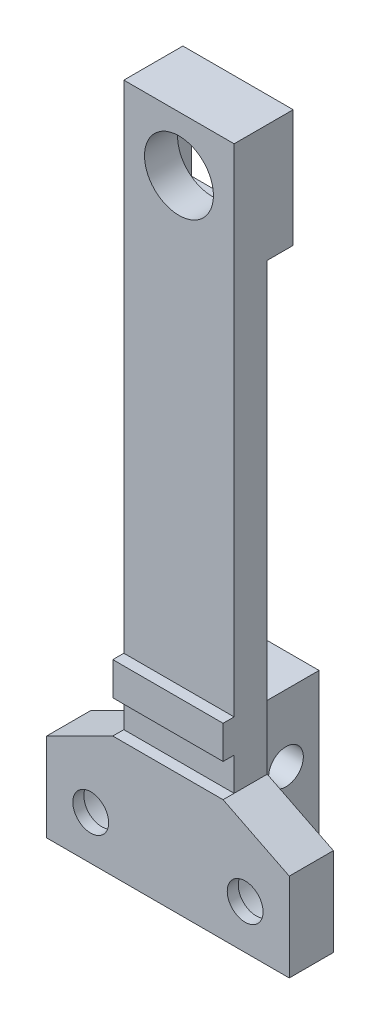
ISO-10303-21;
HEADER;
FILE_DESCRIPTION(('STEP AP214'),'2;1');
FILE_NAME('part.step','',(''),(''),'','','');
FILE_SCHEMA(('AUTOMOTIVE_DESIGN { 1 0 10303 214 1 1 1 1 }'));
ENDSEC;
DATA;
#1=APPLICATION_CONTEXT('core data for automotive mechanical design processes');
#2=APPLICATION_PROTOCOL_DEFINITION('international standard','automotive_design',2000,#1);
#3=PRODUCT_CONTEXT('',#1,'mechanical');
#4=PRODUCT('Part','Part','',(#3));
#5=PRODUCT_RELATED_PRODUCT_CATEGORY('part','',(#4));
#6=PRODUCT_DEFINITION_FORMATION('','',#4);
#7=PRODUCT_DEFINITION_CONTEXT('part definition',#1,'design');
#8=PRODUCT_DEFINITION('design','',#6,#7);
#9=PRODUCT_DEFINITION_SHAPE('','',#8);
#10=(LENGTH_UNIT() NAMED_UNIT(*) SI_UNIT(.MILLI.,.METRE.));
#11=(NAMED_UNIT(*) PLANE_ANGLE_UNIT() SI_UNIT($,.RADIAN.));
#12=(NAMED_UNIT(*) SI_UNIT($,.STERADIAN.) SOLID_ANGLE_UNIT());
#13=UNCERTAINTY_MEASURE_WITH_UNIT(LENGTH_MEASURE(1.E-05),#10,'distance_accuracy_value','');
#14=(GEOMETRIC_REPRESENTATION_CONTEXT(3) GLOBAL_UNCERTAINTY_ASSIGNED_CONTEXT((#13)) GLOBAL_UNIT_ASSIGNED_CONTEXT((#10,
#11,#12)) REPRESENTATION_CONTEXT('',''));
#15=CARTESIAN_POINT('',(0.,0.,0.));
#16=DIRECTION('',(0.,0.,1.));
#17=DIRECTION('',(1.,0.,0.));
#18=AXIS2_PLACEMENT_3D('',#15,#16,#17);
#19=CARTESIAN_POINT('',(0.,0.,0.));
#20=DIRECTION('',(0.,0.,-1.));
#21=DIRECTION('',(-1.,0.,0.));
#22=AXIS2_PLACEMENT_3D('',#19,#20,#21);
#23=PLANE('',#22);
#24=CARTESIAN_POINT('',(0.,25.,0.));
#25=DIRECTION('',(0.,0.,1.));
#26=DIRECTION('',(1.,0.,0.));
#27=AXIS2_PLACEMENT_3D('',#24,#25,#26);
#28=CIRCLE('',#27,3.125);
#29=CARTESIAN_POINT('',(3.125,25.,0.));
#30=VERTEX_POINT('',#29);
#31=EDGE_CURVE('E468',#30,#30,#28,.T.);
#32=ORIENTED_EDGE('',*,*,#31,.T.);
#33=EDGE_LOOP('',(#32));
#34=FACE_BOUND('',#33,.T.);
#35=CARTESIAN_POINT('',(-7.,-28.,0.));
#36=DIRECTION('',(0.,0.,-1.));
#37=DIRECTION('',(-1.,0.,0.));
#38=AXIS2_PLACEMENT_3D('',#35,#36,#37);
#39=CIRCLE('',#38,3.);
#40=CARTESIAN_POINT('',(-10.,-28.,0.));
#41=VERTEX_POINT('',#40);
#42=EDGE_CURVE('E423',#41,#41,#39,.T.);
#43=ORIENTED_EDGE('',*,*,#42,.F.);
#44=EDGE_LOOP('',(#43));
#45=FACE_BOUND('',#44,.T.);
#46=CARTESIAN_POINT('',(7.,-28.,0.));
#47=DIRECTION('',(0.,0.,-1.));
#48=DIRECTION('',(-1.,0.,0.));
#49=AXIS2_PLACEMENT_3D('',#46,#47,#48);
#50=CIRCLE('',#49,3.);
#51=CARTESIAN_POINT('',(4.,-28.,0.));
#52=VERTEX_POINT('',#51);
#53=EDGE_CURVE('E420',#52,#52,#50,.T.);
#54=ORIENTED_EDGE('',*,*,#53,.F.);
#55=EDGE_LOOP('',(#54));
#56=FACE_BOUND('',#55,.T.);
#57=DIRECTION('',(-1.,0.,0.));
#58=VECTOR('',#57,1.);
#59=CARTESIAN_POINT('',(-4.24632371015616,19.3710969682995,0.));
#60=LINE('',#59,#58);
#61=CARTESIAN_POINT('',(-1.,19.3710969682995,0.));
#62=VERTEX_POINT('',#61);
#63=CARTESIAN_POINT('',(-5.,19.3710969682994,0.));
#64=VERTEX_POINT('',#63);
#65=EDGE_CURVE('E389',#62,#64,#60,.T.);
#66=ORIENTED_EDGE('',*,*,#65,.F.);
#67=DIRECTION('',(0.,-1.,0.));
#68=VECTOR('',#67,1.);
#69=CARTESIAN_POINT('',(-1.,19.3710969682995,0.));
#70=LINE('',#69,#68);
#71=CARTESIAN_POINT('',(-1.,20.1710969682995,0.));
#72=VERTEX_POINT('',#71);
#73=EDGE_CURVE('E386',#72,#62,#70,.T.);
#74=ORIENTED_EDGE('',*,*,#73,.F.);
#75=DIRECTION('',(1.,0.,0.));
#76=VECTOR('',#75,1.);
#77=CARTESIAN_POINT('',(-1.,20.1710969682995,0.));
#78=LINE('',#77,#76);
#79=CARTESIAN_POINT('',(-4.2,20.1710969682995,0.));
#80=VERTEX_POINT('',#79);
#81=EDGE_CURVE('E383',#80,#72,#78,.T.);
#82=ORIENTED_EDGE('',*,*,#81,.F.);
#83=DIRECTION('',(0.,-1.,0.));
#84=VECTOR('',#83,1.);
#85=CARTESIAN_POINT('',(-4.2,29.2,0.));
#86=LINE('',#85,#84);
#87=CARTESIAN_POINT('',(-4.2,29.2,0.));
#88=VERTEX_POINT('',#87);
#89=EDGE_CURVE('E380',#88,#80,#86,.T.);
#90=ORIENTED_EDGE('',*,*,#89,.F.);
#91=DIRECTION('',(-1.,0.,0.));
#92=VECTOR('',#91,1.);
#93=CARTESIAN_POINT('',(4.2,29.2,0.));
#94=LINE('',#93,#92);
#95=CARTESIAN_POINT('',(4.2,29.2,0.));
#96=VERTEX_POINT('',#95);
#97=EDGE_CURVE('E377',#96,#88,#94,.T.);
#98=ORIENTED_EDGE('',*,*,#97,.F.);
#99=DIRECTION('',(0.,1.,0.));
#100=VECTOR('',#99,1.);
#101=CARTESIAN_POINT('',(4.2,20.143029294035,0.));
#102=LINE('',#101,#100);
#103=CARTESIAN_POINT('',(4.2,20.143029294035,0.));
#104=VERTEX_POINT('',#103);
#105=EDGE_CURVE('E374',#104,#96,#102,.T.);
#106=ORIENTED_EDGE('',*,*,#105,.F.);
#107=DIRECTION('',(1.,0.,0.));
#108=VECTOR('',#107,1.);
#109=CARTESIAN_POINT('',(0.999999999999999,20.143029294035,0.));
#110=LINE('',#109,#108);
#111=CARTESIAN_POINT('',(0.999999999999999,20.143029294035,0.));
#112=VERTEX_POINT('',#111);
#113=EDGE_CURVE('E371',#112,#104,#110,.T.);
#114=ORIENTED_EDGE('',*,*,#113,.F.);
#115=DIRECTION('',(0.,1.,0.));
#116=VECTOR('',#115,1.);
#117=CARTESIAN_POINT('',(0.999999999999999,19.343029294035,0.));
#118=LINE('',#117,#116);
#119=CARTESIAN_POINT('',(0.999999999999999,19.343029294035,0.));
#120=VERTEX_POINT('',#119);
#121=EDGE_CURVE('E368',#120,#112,#118,.T.);
#122=ORIENTED_EDGE('',*,*,#121,.F.);
#123=DIRECTION('',(-1.,0.,0.));
#124=VECTOR('',#123,1.);
#125=CARTESIAN_POINT('',(4.12072456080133,19.343029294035,0.));
#126=LINE('',#125,#124);
#127=CARTESIAN_POINT('',(5.,19.343029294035,0.));
#128=VERTEX_POINT('',#127);
#129=EDGE_CURVE('E356',#128,#120,#126,.T.);
#130=ORIENTED_EDGE('',*,*,#129,.F.);
#131=DIRECTION('',(0.,1.,0.));
#132=VECTOR('',#131,1.);
#133=CARTESIAN_POINT('',(5.,-30.,0.));
#134=LINE('',#133,#132);
#135=CARTESIAN_POINT('',(5.,-21.,0.));
#136=VERTEX_POINT('',#135);
#137=EDGE_CURVE('E511',#136,#128,#134,.T.);
#138=ORIENTED_EDGE('',*,*,#137,.F.);
#139=DIRECTION('',(0.894427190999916,-0.447213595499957,0.));
#140=VECTOR('',#139,1.);
#141=CARTESIAN_POINT('',(11.,-24.,0.));
#142=LINE('',#141,#140);
#143=CARTESIAN_POINT('',(11.,-24.,0.));
#144=VERTEX_POINT('',#143);
#145=EDGE_CURVE('E451',#136,#144,#142,.T.);
#146=ORIENTED_EDGE('',*,*,#145,.T.);
#147=DIRECTION('',(0.,-1.,0.));
#148=VECTOR('',#147,1.);
#149=CARTESIAN_POINT('',(11.,-30.,0.));
#150=LINE('',#149,#148);
#151=CARTESIAN_POINT('',(11.,-32.,0.));
#152=VERTEX_POINT('',#151);
#153=EDGE_CURVE('E460',#144,#152,#150,.T.);
#154=ORIENTED_EDGE('',*,*,#153,.T.);
#155=DIRECTION('',(-1.,0.,0.));
#156=VECTOR('',#155,1.);
#157=CARTESIAN_POINT('',(11.,-32.,0.));
#158=LINE('',#157,#156);
#159=CARTESIAN_POINT('',(-11.,-32.,0.));
#160=VERTEX_POINT('',#159);
#161=EDGE_CURVE('E419',#152,#160,#158,.T.);
#162=ORIENTED_EDGE('',*,*,#161,.T.);
#163=DIRECTION('',(0.,1.,0.));
#164=VECTOR('',#163,1.);
#165=CARTESIAN_POINT('',(-11.,-30.,0.));
#166=LINE('',#165,#164);
#167=CARTESIAN_POINT('',(-11.,-24.,0.));
#168=VERTEX_POINT('',#167);
#169=EDGE_CURVE('E444',#160,#168,#166,.T.);
#170=ORIENTED_EDGE('',*,*,#169,.T.);
#171=DIRECTION('',(0.894427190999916,0.447213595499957,0.));
#172=VECTOR('',#171,1.);
#173=CARTESIAN_POINT('',(-11.,-24.,0.));
#174=LINE('',#173,#172);
#175=CARTESIAN_POINT('',(-5.,-21.,0.));
#176=VERTEX_POINT('',#175);
#177=EDGE_CURVE('E447',#168,#176,#174,.T.);
#178=ORIENTED_EDGE('',*,*,#177,.T.);
#179=DIRECTION('',(0.,-1.,0.));
#180=VECTOR('',#179,1.);
#181=CARTESIAN_POINT('',(-5.,-30.,0.));
#182=LINE('',#181,#180);
#183=EDGE_CURVE('E518',#64,#176,#182,.T.);
#184=ORIENTED_EDGE('',*,*,#183,.F.);
#185=EDGE_LOOP('',(#66,#74,#82,#90,#98,#106,#114,#122,#130,#138,#146,#154,#162,#170,#178,#184));
#186=FACE_BOUND('',#185,.T.);
#187=DIRECTION('',(0.,1.,0.));
#188=VECTOR('',#187,1.);
#189=CARTESIAN_POINT('',(-3.7008776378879,0.,0.));
#190=LINE('',#189,#188);
#191=CARTESIAN_POINT('',(-3.7008776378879,-30.4999999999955,0.));
#192=VERTEX_POINT('',#191);
#193=CARTESIAN_POINT('',(-3.7008776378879,-16.4999999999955,0.));
#194=VERTEX_POINT('',#193);
#195=EDGE_CURVE('E65',#192,#194,#190,.T.);
#196=ORIENTED_EDGE('',*,*,#195,.F.);
#197=DIRECTION('',(-1.,0.,0.));
#198=VECTOR('',#197,1.);
#199=CARTESIAN_POINT('',(0.,-30.4999999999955,0.));
#200=LINE('',#199,#198);
#201=CARTESIAN_POINT('',(3.70087763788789,-30.4999999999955,0.));
#202=VERTEX_POINT('',#201);
#203=EDGE_CURVE('E302',#202,#192,#200,.T.);
#204=ORIENTED_EDGE('',*,*,#203,.F.);
#205=DIRECTION('',(0.,1.,0.));
#206=VECTOR('',#205,1.);
#207=CARTESIAN_POINT('',(3.70087763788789,0.,0.));
#208=LINE('',#207,#206);
#209=CARTESIAN_POINT('',(3.70087763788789,-16.4999999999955,0.));
#210=VERTEX_POINT('',#209);
#211=EDGE_CURVE('E332',#202,#210,#208,.T.);
#212=ORIENTED_EDGE('',*,*,#211,.T.);
#213=DIRECTION('',(-1.,0.,0.));
#214=VECTOR('',#213,1.);
#215=CARTESIAN_POINT('',(0.,-16.4999999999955,0.));
#216=LINE('',#215,#214);
#217=EDGE_CURVE('E330',#210,#194,#216,.T.);
#218=ORIENTED_EDGE('',*,*,#217,.T.);
#219=EDGE_LOOP('',(#196,#204,#212,#218));
#220=FACE_BOUND('',#219,.T.);
#221=ADVANCED_FACE('F43',(#34,#45,#56,#186,#220),#23,.T.);
#222=CARTESIAN_POINT('',(-5.,-30.,3.));
#223=DIRECTION('',(1.,0.,0.));
#224=DIRECTION('',(0.,0.,-1.));
#225=AXIS2_PLACEMENT_3D('',#222,#223,#224);
#226=PLANE('',#225);
#227=DIRECTION('',(0.,0.,-1.));
#228=VECTOR('',#227,1.);
#229=CARTESIAN_POINT('',(-5.,30.,3.));
#230=LINE('',#229,#228);
#231=CARTESIAN_POINT('',(-5.,30.,3.));
#232=VERTEX_POINT('',#231);
#233=CARTESIAN_POINT('',(-5.,30.,-2.35471075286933));
#234=VERTEX_POINT('',#233);
#235=EDGE_CURVE('E267',#232,#234,#230,.T.);
#236=ORIENTED_EDGE('',*,*,#235,.T.);
#237=DIRECTION('',(0.,1.,0.));
#238=VECTOR('',#237,1.);
#239=CARTESIAN_POINT('',(-5.,17.1848624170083,-2.35471075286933));
#240=LINE('',#239,#238);
#241=CARTESIAN_POINT('',(-5.,19.3710969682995,-2.35471075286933));
#242=VERTEX_POINT('',#241);
#243=EDGE_CURVE('E249',#242,#234,#240,.T.);
#244=ORIENTED_EDGE('',*,*,#243,.F.);
#245=DIRECTION('',(0.,0.,1.));
#246=VECTOR('',#245,1.);
#247=CARTESIAN_POINT('',(-5.,19.3710969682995,-15.));
#248=LINE('',#247,#246);
#249=EDGE_CURVE('E392',#242,#64,#248,.T.);
#250=ORIENTED_EDGE('',*,*,#249,.T.);
#251=ORIENTED_EDGE('',*,*,#183,.T.);
#252=DIRECTION('',(0.,0.,-1.));
#253=VECTOR('',#252,1.);
#254=CARTESIAN_POINT('',(-5.,-21.,4.));
#255=LINE('',#254,#253);
#256=CARTESIAN_POINT('',(-5.,-21.,3.));
#257=VERTEX_POINT('',#256);
#258=EDGE_CURVE('E51',#257,#176,#255,.T.);
#259=ORIENTED_EDGE('',*,*,#258,.F.);
#260=DIRECTION('',(0.,-1.,0.));
#261=VECTOR('',#260,1.);
#262=CARTESIAN_POINT('',(-5.,-30.,3.));
#263=LINE('',#262,#261);
#264=CARTESIAN_POINT('',(-5.,-18.,3.));
#265=VERTEX_POINT('',#264);
#266=EDGE_CURVE('E516',#265,#257,#263,.T.);
#267=ORIENTED_EDGE('',*,*,#266,.F.);
#268=DIRECTION('',(0.,0.,-1.));
#269=VECTOR('',#268,1.);
#270=CARTESIAN_POINT('',(-5.,-18.,4.));
#271=LINE('',#270,#269);
#272=CARTESIAN_POINT('',(-5.,-18.,4.));
#273=VERTEX_POINT('',#272);
#274=EDGE_CURVE('E471',#273,#265,#271,.T.);
#275=ORIENTED_EDGE('',*,*,#274,.F.);
#276=DIRECTION('',(0.,-1.,0.));
#277=VECTOR('',#276,1.);
#278=CARTESIAN_POINT('',(-5.,-18.,4.));
#279=LINE('',#278,#277);
#280=CARTESIAN_POINT('',(-5.,-15.,4.));
#281=VERTEX_POINT('',#280);
#282=EDGE_CURVE('E490',#281,#273,#279,.T.);
#283=ORIENTED_EDGE('',*,*,#282,.F.);
#284=DIRECTION('',(0.,0.,-1.));
#285=VECTOR('',#284,1.);
#286=CARTESIAN_POINT('',(-5.,-15.,4.));
#287=LINE('',#286,#285);
#288=CARTESIAN_POINT('',(-5.,-15.,3.));
#289=VERTEX_POINT('',#288);
#290=EDGE_CURVE('E482',#281,#289,#287,.T.);
#291=ORIENTED_EDGE('',*,*,#290,.T.);
#292=EDGE_CURVE('E271',#232,#289,#263,.T.);
#293=ORIENTED_EDGE('',*,*,#292,.F.);
#294=EDGE_LOOP('',(#236,#244,#250,#251,#259,#267,#275,#283,#291,#293));
#295=FACE_BOUND('',#294,.T.);
#296=ADVANCED_FACE('F628',(#295),#226,.F.);
#297=CARTESIAN_POINT('',(0.,0.,3.));
#298=DIRECTION('',(0.,0.,-1.));
#299=DIRECTION('',(-1.,0.,0.));
#300=AXIS2_PLACEMENT_3D('',#297,#298,#299);
#301=PLANE('',#300);
#302=DIRECTION('',(1.,0.,0.));
#303=VECTOR('',#302,1.);
#304=CARTESIAN_POINT('',(-5.,-18.,3.));
#305=LINE('',#304,#303);
#306=CARTESIAN_POINT('',(5.,-18.,3.));
#307=VERTEX_POINT('',#306);
#308=EDGE_CURVE('E489',#265,#307,#305,.T.);
#309=ORIENTED_EDGE('',*,*,#308,.F.);
#310=ORIENTED_EDGE('',*,*,#266,.T.);
#311=DIRECTION('',(-1.,0.,0.));
#312=VECTOR('',#311,1.);
#313=CARTESIAN_POINT('',(5.,-21.,3.));
#314=LINE('',#313,#312);
#315=CARTESIAN_POINT('',(5.,-21.,3.));
#316=VERTEX_POINT('',#315);
#317=EDGE_CURVE('E493',#316,#257,#314,.T.);
#318=ORIENTED_EDGE('',*,*,#317,.F.);
#319=DIRECTION('',(0.,1.,0.));
#320=VECTOR('',#319,1.);
#321=CARTESIAN_POINT('',(5.,-30.,3.));
#322=LINE('',#321,#320);
#323=EDGE_CURVE('E512',#316,#307,#322,.T.);
#324=ORIENTED_EDGE('',*,*,#323,.T.);
#325=EDGE_LOOP('',(#309,#310,#318,#324));
#326=FACE_BOUND('',#325,.T.);
#327=ADVANCED_FACE('F540',(#326),#301,.F.);
#328=CARTESIAN_POINT('',(0.,25.,3.));
#329=DIRECTION('',(0.,0.,1.));
#330=DIRECTION('',(1.,0.,0.));
#331=AXIS2_PLACEMENT_3D('',#328,#329,#330);
#332=CIRCLE('',#331,3.125);
#333=CARTESIAN_POINT('',(3.125,25.,3.));
#334=VERTEX_POINT('',#333);
#335=EDGE_CURVE('E466',#334,#334,#332,.T.);
#336=ORIENTED_EDGE('',*,*,#335,.F.);
#337=EDGE_LOOP('',(#336));
#338=FACE_BOUND('',#337,.T.);
#339=DIRECTION('',(-1.,0.,0.));
#340=VECTOR('',#339,1.);
#341=CARTESIAN_POINT('',(-5.,-15.,3.));
#342=LINE('',#341,#340);
#343=CARTESIAN_POINT('',(5.,-15.,3.));
#344=VERTEX_POINT('',#343);
#345=EDGE_CURVE('E486',#344,#289,#342,.T.);
#346=ORIENTED_EDGE('',*,*,#345,.F.);
#347=CARTESIAN_POINT('',(5.,30.,3.));
#348=VERTEX_POINT('',#347);
#349=EDGE_CURVE('E514',#344,#348,#322,.T.);
#350=ORIENTED_EDGE('',*,*,#349,.T.);
#351=DIRECTION('',(-1.,0.,0.));
#352=VECTOR('',#351,1.);
#353=CARTESIAN_POINT('',(-5.,30.,3.));
#354=LINE('',#353,#352);
#355=EDGE_CURVE('E265',#348,#232,#354,.T.);
#356=ORIENTED_EDGE('',*,*,#355,.T.);
#357=ORIENTED_EDGE('',*,*,#292,.T.);
#358=EDGE_LOOP('',(#346,#350,#356,#357));
#359=FACE_BOUND('',#358,.T.);
#360=ADVANCED_FACE('F522',(#338,#359),#301,.F.);
#361=CARTESIAN_POINT('',(5.,-30.,3.));
#362=DIRECTION('',(-1.,0.,0.));
#363=DIRECTION('',(0.,0.,1.));
#364=AXIS2_PLACEMENT_3D('',#361,#362,#363);
#365=PLANE('',#364);
#366=DIRECTION('',(0.,0.,1.));
#367=VECTOR('',#366,1.);
#368=CARTESIAN_POINT('',(5.,19.343029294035,-15.));
#369=LINE('',#368,#367);
#370=CARTESIAN_POINT('',(5.,19.343029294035,-2.35471075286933));
#371=VERTEX_POINT('',#370);
#372=EDGE_CURVE('E261',#371,#128,#369,.T.);
#373=ORIENTED_EDGE('',*,*,#372,.F.);
#374=DIRECTION('',(0.,1.,0.));
#375=VECTOR('',#374,1.);
#376=CARTESIAN_POINT('',(5.,17.1848624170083,-2.35471075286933));
#377=LINE('',#376,#375);
#378=CARTESIAN_POINT('',(5.,30.,-2.35471075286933));
#379=VERTEX_POINT('',#378);
#380=EDGE_CURVE('E246',#371,#379,#377,.T.);
#381=ORIENTED_EDGE('',*,*,#380,.T.);
#382=DIRECTION('',(0.,0.,-1.));
#383=VECTOR('',#382,1.);
#384=CARTESIAN_POINT('',(5.,30.,3.));
#385=LINE('',#384,#383);
#386=EDGE_CURVE('E259',#348,#379,#385,.T.);
#387=ORIENTED_EDGE('',*,*,#386,.F.);
#388=ORIENTED_EDGE('',*,*,#349,.F.);
#389=DIRECTION('',(0.,0.,-1.));
#390=VECTOR('',#389,1.);
#391=CARTESIAN_POINT('',(5.,-15.,4.));
#392=LINE('',#391,#390);
#393=CARTESIAN_POINT('',(5.,-15.,4.));
#394=VERTEX_POINT('',#393);
#395=EDGE_CURVE('E479',#394,#344,#392,.T.);
#396=ORIENTED_EDGE('',*,*,#395,.F.);
#397=DIRECTION('',(0.,1.,0.));
#398=VECTOR('',#397,1.);
#399=CARTESIAN_POINT('',(5.,-18.,4.));
#400=LINE('',#399,#398);
#401=CARTESIAN_POINT('',(5.,-18.,4.));
#402=VERTEX_POINT('',#401);
#403=EDGE_CURVE('E495',#402,#394,#400,.T.);
#404=ORIENTED_EDGE('',*,*,#403,.F.);
#405=DIRECTION('',(0.,0.,-1.));
#406=VECTOR('',#405,1.);
#407=CARTESIAN_POINT('',(5.,-18.,4.));
#408=LINE('',#407,#406);
#409=EDGE_CURVE('E476',#402,#307,#408,.T.);
#410=ORIENTED_EDGE('',*,*,#409,.T.);
#411=ORIENTED_EDGE('',*,*,#323,.F.);
#412=DIRECTION('',(0.,0.,-1.));
#413=VECTOR('',#412,1.);
#414=CARTESIAN_POINT('',(5.,-21.,4.));
#415=LINE('',#414,#413);
#416=EDGE_CURVE('E266',#316,#136,#415,.T.);
#417=ORIENTED_EDGE('',*,*,#416,.T.);
#418=ORIENTED_EDGE('',*,*,#137,.T.);
#419=EDGE_LOOP('',(#373,#381,#387,#388,#396,#404,#410,#411,#417,#418));
#420=FACE_BOUND('',#419,.T.);
#421=ADVANCED_FACE('F45',(#420),#365,.F.);
#422=CARTESIAN_POINT('',(-5.,30.,3.));
#423=DIRECTION('',(0.,-1.,0.));
#424=DIRECTION('',(0.,0.,-1.));
#425=AXIS2_PLACEMENT_3D('',#422,#423,#424);
#426=PLANE('',#425);
#427=ORIENTED_EDGE('',*,*,#386,.T.);
#428=DIRECTION('',(-1.,0.,0.));
#429=VECTOR('',#428,1.);
#430=CARTESIAN_POINT('',(5.,30.,-2.35471075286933));
#431=LINE('',#430,#429);
#432=EDGE_CURVE('E243',#379,#234,#431,.T.);
#433=ORIENTED_EDGE('',*,*,#432,.T.);
#434=ORIENTED_EDGE('',*,*,#235,.F.);
#435=ORIENTED_EDGE('',*,*,#355,.F.);
#436=EDGE_LOOP('',(#427,#433,#434,#435));
#437=FACE_BOUND('',#436,.T.);
#438=ADVANCED_FACE('F264',(#437),#426,.F.);
#439=CARTESIAN_POINT('',(5.,-21.,4.));
#440=DIRECTION('',(0.,-1.,0.));
#441=DIRECTION('',(0.,0.,-1.));
#442=AXIS2_PLACEMENT_3D('',#439,#440,#441);
#443=PLANE('',#442);
#444=ORIENTED_EDGE('',*,*,#317,.T.);
#445=DIRECTION('',(0.,0.,-1.));
#446=VECTOR('',#445,1.);
#447=CARTESIAN_POINT('',(-5.,-21.,4.));
#448=LINE('',#447,#446);
#449=CARTESIAN_POINT('',(-5.,-21.,4.));
#450=VERTEX_POINT('',#449);
#451=EDGE_CURVE('E503',#450,#257,#448,.T.);
#452=ORIENTED_EDGE('',*,*,#451,.F.);
#453=DIRECTION('',(-1.,0.,0.));
#454=VECTOR('',#453,1.);
#455=CARTESIAN_POINT('',(5.,-21.,4.));
#456=LINE('',#455,#454);
#457=CARTESIAN_POINT('',(5.,-21.,4.));
#458=VERTEX_POINT('',#457);
#459=EDGE_CURVE('E501',#458,#450,#456,.T.);
#460=ORIENTED_EDGE('',*,*,#459,.F.);
#461=DIRECTION('',(0.,0.,-1.));
#462=VECTOR('',#461,1.);
#463=CARTESIAN_POINT('',(5.,-21.,4.));
#464=LINE('',#463,#462);
#465=EDGE_CURVE('E508',#458,#316,#464,.T.);
#466=ORIENTED_EDGE('',*,*,#465,.T.);
#467=EDGE_LOOP('',(#444,#452,#460,#466));
#468=FACE_BOUND('',#467,.T.);
#469=ADVANCED_FACE('F544',(#468),#443,.F.);
#470=CARTESIAN_POINT('',(0.,0.,4.));
#471=DIRECTION('',(0.,0.,1.));
#472=DIRECTION('',(1.,0.,0.));
#473=AXIS2_PLACEMENT_3D('',#470,#471,#472);
#474=PLANE('',#473);
#475=CARTESIAN_POINT('',(7.,-28.,4.));
#476=DIRECTION('',(0.,0.,1.));
#477=DIRECTION('',(1.,0.,0.));
#478=AXIS2_PLACEMENT_3D('',#475,#476,#477);
#479=CIRCLE('',#478,1.625);
#480=CARTESIAN_POINT('',(8.625,-28.,4.));
#481=VERTEX_POINT('',#480);
#482=EDGE_CURVE('E278',#481,#481,#479,.T.);
#483=ORIENTED_EDGE('',*,*,#482,.F.);
#484=EDGE_LOOP('',(#483));
#485=FACE_BOUND('',#484,.T.);
#486=CARTESIAN_POINT('',(-7.,-28.,4.));
#487=DIRECTION('',(0.,0.,1.));
#488=DIRECTION('',(1.,0.,0.));
#489=AXIS2_PLACEMENT_3D('',#486,#487,#488);
#490=CIRCLE('',#489,1.625);
#491=CARTESIAN_POINT('',(-5.375,-28.,4.));
#492=VERTEX_POINT('',#491);
#493=EDGE_CURVE('E275',#492,#492,#490,.T.);
#494=ORIENTED_EDGE('',*,*,#493,.F.);
#495=EDGE_LOOP('',(#494));
#496=FACE_BOUND('',#495,.T.);
#497=DIRECTION('',(0.,1.,0.));
#498=VECTOR('',#497,1.);
#499=CARTESIAN_POINT('',(-11.,-30.,4.));
#500=LINE('',#499,#498);
#501=CARTESIAN_POINT('',(-11.,-32.,4.));
#502=VERTEX_POINT('',#501);
#503=CARTESIAN_POINT('',(-11.,-24.,4.));
#504=VERTEX_POINT('',#503);
#505=EDGE_CURVE('E443',#502,#504,#500,.T.);
#506=ORIENTED_EDGE('',*,*,#505,.F.);
#507=DIRECTION('',(-1.,0.,0.));
#508=VECTOR('',#507,1.);
#509=CARTESIAN_POINT('',(11.,-32.,4.));
#510=LINE('',#509,#508);
#511=CARTESIAN_POINT('',(11.,-32.,4.));
#512=VERTEX_POINT('',#511);
#513=EDGE_CURVE('E428',#512,#502,#510,.T.);
#514=ORIENTED_EDGE('',*,*,#513,.F.);
#515=DIRECTION('',(0.,-1.,0.));
#516=VECTOR('',#515,1.);
#517=CARTESIAN_POINT('',(11.,-30.,4.));
#518=LINE('',#517,#516);
#519=CARTESIAN_POINT('',(11.,-24.,4.));
#520=VERTEX_POINT('',#519);
#521=EDGE_CURVE('E459',#520,#512,#518,.T.);
#522=ORIENTED_EDGE('',*,*,#521,.F.);
#523=DIRECTION('',(0.894427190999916,-0.447213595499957,0.));
#524=VECTOR('',#523,1.);
#525=CARTESIAN_POINT('',(11.,-24.,4.));
#526=LINE('',#525,#524);
#527=EDGE_CURVE('E456',#458,#520,#526,.T.);
#528=ORIENTED_EDGE('',*,*,#527,.F.);
#529=ORIENTED_EDGE('',*,*,#459,.T.);
#530=DIRECTION('',(0.894427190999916,0.447213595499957,0.));
#531=VECTOR('',#530,1.);
#532=CARTESIAN_POINT('',(-11.,-24.,4.));
#533=LINE('',#532,#531);
#534=EDGE_CURVE('E448',#504,#450,#533,.T.);
#535=ORIENTED_EDGE('',*,*,#534,.F.);
#536=EDGE_LOOP('',(#506,#514,#522,#528,#529,#535));
#537=FACE_BOUND('',#536,.T.);
#538=ADVANCED_FACE('F551',(#485,#496,#537),#474,.T.);
#539=CARTESIAN_POINT('',(-5.,-18.,4.));
#540=DIRECTION('',(0.,1.,0.));
#541=DIRECTION('',(0.,0.,1.));
#542=AXIS2_PLACEMENT_3D('',#539,#540,#541);
#543=PLANE('',#542);
#544=ORIENTED_EDGE('',*,*,#308,.T.);
#545=ORIENTED_EDGE('',*,*,#409,.F.);
#546=DIRECTION('',(1.,0.,0.));
#547=VECTOR('',#546,1.);
#548=CARTESIAN_POINT('',(-5.,-18.,4.));
#549=LINE('',#548,#547);
#550=EDGE_CURVE('E497',#273,#402,#549,.T.);
#551=ORIENTED_EDGE('',*,*,#550,.F.);
#552=ORIENTED_EDGE('',*,*,#274,.T.);
#553=EDGE_LOOP('',(#544,#545,#551,#552));
#554=FACE_BOUND('',#553,.T.);
#555=ADVANCED_FACE('F536',(#554),#543,.F.);
#556=CARTESIAN_POINT('',(-5.,-15.,4.));
#557=DIRECTION('',(0.,-1.,0.));
#558=DIRECTION('',(0.,0.,-1.));
#559=AXIS2_PLACEMENT_3D('',#556,#557,#558);
#560=PLANE('',#559);
#561=ORIENTED_EDGE('',*,*,#345,.T.);
#562=ORIENTED_EDGE('',*,*,#290,.F.);
#563=DIRECTION('',(-1.,0.,0.));
#564=VECTOR('',#563,1.);
#565=CARTESIAN_POINT('',(-5.,-15.,4.));
#566=LINE('',#565,#564);
#567=EDGE_CURVE('E485',#394,#281,#566,.T.);
#568=ORIENTED_EDGE('',*,*,#567,.F.);
#569=ORIENTED_EDGE('',*,*,#395,.T.);
#570=EDGE_LOOP('',(#561,#562,#568,#569));
#571=FACE_BOUND('',#570,.T.);
#572=ADVANCED_FACE('F527',(#571),#560,.F.);
#573=CARTESIAN_POINT('',(0.,0.,4.));
#574=DIRECTION('',(0.,0.,-1.));
#575=DIRECTION('',(-1.,0.,0.));
#576=AXIS2_PLACEMENT_3D('',#573,#574,#575);
#577=PLANE('',#576);
#578=ORIENTED_EDGE('',*,*,#282,.T.);
#579=ORIENTED_EDGE('',*,*,#550,.T.);
#580=ORIENTED_EDGE('',*,*,#403,.T.);
#581=ORIENTED_EDGE('',*,*,#567,.T.);
#582=EDGE_LOOP('',(#578,#579,#580,#581));
#583=FACE_BOUND('',#582,.T.);
#584=ADVANCED_FACE('F531',(#583),#577,.F.);
#585=CARTESIAN_POINT('',(0.,25.,0.));
#586=DIRECTION('',(0.,0.,1.));
#587=DIRECTION('',(1.,0.,0.));
#588=AXIS2_PLACEMENT_3D('',#585,#586,#587);
#589=CYLINDRICAL_SURFACE('',#588,3.125);
#590=ORIENTED_EDGE('',*,*,#31,.F.);
#591=EDGE_LOOP('',(#590));
#592=FACE_BOUND('',#591,.T.);
#593=ORIENTED_EDGE('',*,*,#335,.T.);
#594=EDGE_LOOP('',(#593));
#595=FACE_BOUND('',#594,.T.);
#596=ADVANCED_FACE('F964',(#592,#595),#589,.F.);
#597=CARTESIAN_POINT('',(11.,-30.,4.));
#598=DIRECTION('',(1.,0.,0.));
#599=DIRECTION('',(0.,0.,-1.));
#600=AXIS2_PLACEMENT_3D('',#597,#598,#599);
#601=PLANE('',#600);
#602=ORIENTED_EDGE('',*,*,#153,.F.);
#603=DIRECTION('',(0.,0.,-1.));
#604=VECTOR('',#603,1.);
#605=CARTESIAN_POINT('',(11.,-24.,4.));
#606=LINE('',#605,#604);
#607=EDGE_CURVE('E462',#520,#144,#606,.T.);
#608=ORIENTED_EDGE('',*,*,#607,.F.);
#609=ORIENTED_EDGE('',*,*,#521,.T.);
#610=DIRECTION('',(0.,0.,-1.));
#611=VECTOR('',#610,1.);
#612=CARTESIAN_POINT('',(11.,-32.,4.));
#613=LINE('',#612,#611);
#614=EDGE_CURVE('E431',#512,#152,#613,.T.);
#615=ORIENTED_EDGE('',*,*,#614,.T.);
#616=EDGE_LOOP('',(#602,#608,#609,#615));
#617=FACE_BOUND('',#616,.T.);
#618=ADVANCED_FACE('F955',(#617),#601,.T.);
#619=CARTESIAN_POINT('',(11.,-24.,4.));
#620=DIRECTION('',(0.447213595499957,0.894427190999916,0.));
#621=DIRECTION('',(-0.894427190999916,0.447213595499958,0.));
#622=AXIS2_PLACEMENT_3D('',#619,#620,#621);
#623=PLANE('',#622);
#624=ORIENTED_EDGE('',*,*,#145,.F.);
#625=ORIENTED_EDGE('',*,*,#416,.F.);
#626=ORIENTED_EDGE('',*,*,#465,.F.);
#627=ORIENTED_EDGE('',*,*,#527,.T.);
#628=ORIENTED_EDGE('',*,*,#607,.T.);
#629=EDGE_LOOP('',(#624,#625,#626,#627,#628));
#630=FACE_BOUND('',#629,.T.);
#631=ADVANCED_FACE('F564',(#630),#623,.T.);
#632=CARTESIAN_POINT('',(-11.,-24.,4.));
#633=DIRECTION('',(-0.447213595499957,0.894427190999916,0.));
#634=DIRECTION('',(-0.894427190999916,-0.447213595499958,0.));
#635=AXIS2_PLACEMENT_3D('',#632,#633,#634);
#636=PLANE('',#635);
#637=ORIENTED_EDGE('',*,*,#177,.F.);
#638=DIRECTION('',(0.,0.,-1.));
#639=VECTOR('',#638,1.);
#640=CARTESIAN_POINT('',(-11.,-24.,4.));
#641=LINE('',#640,#639);
#642=EDGE_CURVE('E437',#504,#168,#641,.T.);
#643=ORIENTED_EDGE('',*,*,#642,.F.);
#644=ORIENTED_EDGE('',*,*,#534,.T.);
#645=ORIENTED_EDGE('',*,*,#451,.T.);
#646=ORIENTED_EDGE('',*,*,#258,.T.);
#647=EDGE_LOOP('',(#637,#643,#644,#645,#646));
#648=FACE_BOUND('',#647,.T.);
#649=ADVANCED_FACE('F548',(#648),#636,.T.);
#650=CARTESIAN_POINT('',(-11.,-30.,4.));
#651=DIRECTION('',(-1.,0.,0.));
#652=DIRECTION('',(0.,0.,1.));
#653=AXIS2_PLACEMENT_3D('',#650,#651,#652);
#654=PLANE('',#653);
#655=ORIENTED_EDGE('',*,*,#169,.F.);
#656=DIRECTION('',(0.,0.,-1.));
#657=VECTOR('',#656,1.);
#658=CARTESIAN_POINT('',(-11.,-32.,4.));
#659=LINE('',#658,#657);
#660=EDGE_CURVE('E434',#502,#160,#659,.T.);
#661=ORIENTED_EDGE('',*,*,#660,.F.);
#662=ORIENTED_EDGE('',*,*,#505,.T.);
#663=ORIENTED_EDGE('',*,*,#642,.T.);
#664=EDGE_LOOP('',(#655,#661,#662,#663));
#665=FACE_BOUND('',#664,.T.);
#666=ADVANCED_FACE('F556',(#665),#654,.T.);
#667=CARTESIAN_POINT('',(11.,-32.,4.));
#668=DIRECTION('',(0.,-1.,0.));
#669=DIRECTION('',(0.,0.,-1.));
#670=AXIS2_PLACEMENT_3D('',#667,#668,#669);
#671=PLANE('',#670);
#672=ORIENTED_EDGE('',*,*,#161,.F.);
#673=ORIENTED_EDGE('',*,*,#614,.F.);
#674=ORIENTED_EDGE('',*,*,#513,.T.);
#675=ORIENTED_EDGE('',*,*,#660,.T.);
#676=EDGE_LOOP('',(#672,#673,#674,#675));
#677=FACE_BOUND('',#676,.T.);
#678=ADVANCED_FACE('F560',(#677),#671,.T.);
#679=CARTESIAN_POINT('',(-7.,-28.,3.));
#680=DIRECTION('',(0.,0.,-1.));
#681=DIRECTION('',(-1.,0.,0.));
#682=AXIS2_PLACEMENT_3D('',#679,#680,#681);
#683=CYLINDRICAL_SURFACE('',#682,3.);
#684=CARTESIAN_POINT('',(-7.,-28.,3.));
#685=DIRECTION('',(0.,0.,-1.));
#686=DIRECTION('',(-1.,0.,0.));
#687=AXIS2_PLACEMENT_3D('',#684,#685,#686);
#688=CIRCLE('',#687,3.);
#689=CARTESIAN_POINT('',(-10.,-28.,3.));
#690=VERTEX_POINT('',#689);
#691=EDGE_CURVE('E281',#690,#690,#688,.T.);
#692=ORIENTED_EDGE('',*,*,#691,.F.);
#693=EDGE_LOOP('',(#692));
#694=FACE_BOUND('',#693,.T.);
#695=ORIENTED_EDGE('',*,*,#42,.T.);
#696=EDGE_LOOP('',(#695));
#697=FACE_BOUND('',#696,.T.);
#698=ADVANCED_FACE('F911',(#694,#697),#683,.F.);
#699=CARTESIAN_POINT('',(-7.,-28.,3.));
#700=DIRECTION('',(0.,0.,-1.));
#701=DIRECTION('',(-1.,0.,0.));
#702=AXIS2_PLACEMENT_3D('',#699,#700,#701);
#703=PLANE('',#702);
#704=CARTESIAN_POINT('',(-7.,-28.,3.));
#705=DIRECTION('',(0.,0.,-1.));
#706=DIRECTION('',(-1.,0.,0.));
#707=AXIS2_PLACEMENT_3D('',#704,#705,#706);
#708=CIRCLE('',#707,1.625);
#709=CARTESIAN_POINT('',(-8.625,-28.,3.));
#710=VERTEX_POINT('',#709);
#711=EDGE_CURVE('E411',#710,#710,#708,.T.);
#712=ORIENTED_EDGE('',*,*,#711,.F.);
#713=EDGE_LOOP('',(#712));
#714=FACE_BOUND('',#713,.T.);
#715=ORIENTED_EDGE('',*,*,#691,.T.);
#716=EDGE_LOOP('',(#715));
#717=FACE_BOUND('',#716,.T.);
#718=ADVANCED_FACE('F901',(#714,#717),#703,.T.);
#719=CARTESIAN_POINT('',(7.,-28.,3.));
#720=DIRECTION('',(0.,0.,-1.));
#721=DIRECTION('',(-1.,0.,0.));
#722=AXIS2_PLACEMENT_3D('',#719,#720,#721);
#723=CYLINDRICAL_SURFACE('',#722,3.);
#724=CARTESIAN_POINT('',(7.,-28.,3.));
#725=DIRECTION('',(0.,0.,-1.));
#726=DIRECTION('',(-1.,0.,0.));
#727=AXIS2_PLACEMENT_3D('',#724,#725,#726);
#728=CIRCLE('',#727,3.);
#729=CARTESIAN_POINT('',(4.,-28.,3.));
#730=VERTEX_POINT('',#729);
#731=EDGE_CURVE('E416',#730,#730,#728,.T.);
#732=ORIENTED_EDGE('',*,*,#731,.F.);
#733=EDGE_LOOP('',(#732));
#734=FACE_BOUND('',#733,.T.);
#735=ORIENTED_EDGE('',*,*,#53,.T.);
#736=EDGE_LOOP('',(#735));
#737=FACE_BOUND('',#736,.T.);
#738=ADVANCED_FACE('F891',(#734,#737),#723,.F.);
#739=CARTESIAN_POINT('',(7.,-28.,3.));
#740=DIRECTION('',(0.,0.,-1.));
#741=DIRECTION('',(-1.,0.,0.));
#742=AXIS2_PLACEMENT_3D('',#739,#740,#741);
#743=PLANE('',#742);
#744=CARTESIAN_POINT('',(7.,-28.,3.));
#745=DIRECTION('',(0.,0.,-1.));
#746=DIRECTION('',(-1.,0.,0.));
#747=AXIS2_PLACEMENT_3D('',#744,#745,#746);
#748=CIRCLE('',#747,1.625);
#749=CARTESIAN_POINT('',(5.375,-28.,3.));
#750=VERTEX_POINT('',#749);
#751=EDGE_CURVE('E279',#750,#750,#748,.T.);
#752=ORIENTED_EDGE('',*,*,#751,.F.);
#753=EDGE_LOOP('',(#752));
#754=FACE_BOUND('',#753,.T.);
#755=ORIENTED_EDGE('',*,*,#731,.T.);
#756=EDGE_LOOP('',(#755));
#757=FACE_BOUND('',#756,.T.);
#758=ADVANCED_FACE('F881',(#754,#757),#743,.T.);
#759=CARTESIAN_POINT('',(-7.,-28.,7.));
#760=DIRECTION('',(0.,0.,-1.));
#761=DIRECTION('',(-1.,0.,0.));
#762=AXIS2_PLACEMENT_3D('',#759,#760,#761);
#763=CYLINDRICAL_SURFACE('',#762,1.625);
#764=ORIENTED_EDGE('',*,*,#493,.T.);
#765=EDGE_LOOP('',(#764));
#766=FACE_BOUND('',#765,.T.);
#767=ORIENTED_EDGE('',*,*,#711,.T.);
#768=EDGE_LOOP('',(#767));
#769=FACE_BOUND('',#768,.T.);
#770=ADVANCED_FACE('F871',(#766,#769),#763,.F.);
#771=CARTESIAN_POINT('',(7.,-28.,7.));
#772=DIRECTION('',(0.,0.,-1.));
#773=DIRECTION('',(-1.,0.,0.));
#774=AXIS2_PLACEMENT_3D('',#771,#772,#773);
#775=CYLINDRICAL_SURFACE('',#774,1.625);
#776=ORIENTED_EDGE('',*,*,#482,.T.);
#777=EDGE_LOOP('',(#776));
#778=FACE_BOUND('',#777,.T.);
#779=ORIENTED_EDGE('',*,*,#751,.T.);
#780=EDGE_LOOP('',(#779));
#781=FACE_BOUND('',#780,.T.);
#782=ADVANCED_FACE('F862',(#778,#781),#775,.F.);
#783=CARTESIAN_POINT('',(4.12072456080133,19.343029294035,-15.));
#784=DIRECTION('',(0.,1.,0.));
#785=DIRECTION('',(0.,0.,1.));
#786=AXIS2_PLACEMENT_3D('',#783,#784,#785);
#787=PLANE('',#786);
#788=DIRECTION('',(0.,0.,1.));
#789=VECTOR('',#788,1.);
#790=CARTESIAN_POINT('',(0.999999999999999,19.343029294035,-15.));
#791=LINE('',#790,#789);
#792=CARTESIAN_POINT('',(0.999999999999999,19.343029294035,-2.35471075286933));
#793=VERTEX_POINT('',#792);
#794=EDGE_CURVE('E408',#793,#120,#791,.T.);
#795=ORIENTED_EDGE('',*,*,#794,.F.);
#796=DIRECTION('',(1.,0.,0.));
#797=VECTOR('',#796,1.);
#798=CARTESIAN_POINT('',(4.12072456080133,19.343029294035,-2.35471075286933));
#799=LINE('',#798,#797);
#800=EDGE_CURVE('E292',#793,#371,#799,.T.);
#801=ORIENTED_EDGE('',*,*,#800,.T.);
#802=ORIENTED_EDGE('',*,*,#372,.T.);
#803=ORIENTED_EDGE('',*,*,#129,.T.);
#804=EDGE_LOOP('',(#795,#801,#802,#803));
#805=FACE_BOUND('',#804,.T.);
#806=ADVANCED_FACE('F574',(#805),#787,.F.);
#807=CARTESIAN_POINT('',(0.999999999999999,19.343029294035,-15.));
#808=DIRECTION('',(1.,0.,0.));
#809=DIRECTION('',(0.,0.,-1.));
#810=AXIS2_PLACEMENT_3D('',#807,#808,#809);
#811=PLANE('',#810);
#812=DIRECTION('',(0.,0.,1.));
#813=VECTOR('',#812,1.);
#814=CARTESIAN_POINT('',(0.999999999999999,20.143029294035,-15.));
#815=LINE('',#814,#813);
#816=CARTESIAN_POINT('',(0.999999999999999,20.143029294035,-2.35471075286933));
#817=VERTEX_POINT('',#816);
#818=EDGE_CURVE('E406',#817,#112,#815,.T.);
#819=ORIENTED_EDGE('',*,*,#818,.F.);
#820=DIRECTION('',(0.,-1.,0.));
#821=VECTOR('',#820,1.);
#822=CARTESIAN_POINT('',(0.999999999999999,19.343029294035,-2.35471075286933));
#823=LINE('',#822,#821);
#824=EDGE_CURVE('E296',#817,#793,#823,.T.);
#825=ORIENTED_EDGE('',*,*,#824,.T.);
#826=ORIENTED_EDGE('',*,*,#794,.T.);
#827=ORIENTED_EDGE('',*,*,#121,.T.);
#828=EDGE_LOOP('',(#819,#825,#826,#827));
#829=FACE_BOUND('',#828,.T.);
#830=ADVANCED_FACE('F579',(#829),#811,.F.);
#831=CARTESIAN_POINT('',(0.999999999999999,20.143029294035,-15.));
#832=DIRECTION('',(0.,-1.,0.));
#833=DIRECTION('',(0.,0.,-1.));
#834=AXIS2_PLACEMENT_3D('',#831,#832,#833);
#835=PLANE('',#834);
#836=DIRECTION('',(0.,0.,1.));
#837=VECTOR('',#836,1.);
#838=CARTESIAN_POINT('',(4.2,20.143029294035,-15.));
#839=LINE('',#838,#837);
#840=CARTESIAN_POINT('',(4.2,20.143029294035,-2.35471075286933));
#841=VERTEX_POINT('',#840);
#842=EDGE_CURVE('E404',#841,#104,#839,.T.);
#843=ORIENTED_EDGE('',*,*,#842,.F.);
#844=DIRECTION('',(-1.,0.,0.));
#845=VECTOR('',#844,1.);
#846=CARTESIAN_POINT('',(0.999999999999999,20.143029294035,-2.35471075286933));
#847=LINE('',#846,#845);
#848=EDGE_CURVE('E580',#841,#817,#847,.T.);
#849=ORIENTED_EDGE('',*,*,#848,.T.);
#850=ORIENTED_EDGE('',*,*,#818,.T.);
#851=ORIENTED_EDGE('',*,*,#113,.T.);
#852=EDGE_LOOP('',(#843,#849,#850,#851));
#853=FACE_BOUND('',#852,.T.);
#854=ADVANCED_FACE('F618',(#853),#835,.F.);
#855=CARTESIAN_POINT('',(4.2,20.143029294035,-15.));
#856=DIRECTION('',(1.,0.,0.));
#857=DIRECTION('',(0.,0.,-1.));
#858=AXIS2_PLACEMENT_3D('',#855,#856,#857);
#859=PLANE('',#858);
#860=DIRECTION('',(0.,0.,1.));
#861=VECTOR('',#860,1.);
#862=CARTESIAN_POINT('',(4.2,29.2,-15.));
#863=LINE('',#862,#861);
#864=CARTESIAN_POINT('',(4.2,29.2,-2.35471075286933));
#865=VERTEX_POINT('',#864);
#866=EDGE_CURVE('E402',#865,#96,#863,.T.);
#867=ORIENTED_EDGE('',*,*,#866,.F.);
#868=DIRECTION('',(0.,-1.,0.));
#869=VECTOR('',#868,1.);
#870=CARTESIAN_POINT('',(4.2,20.143029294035,-2.35471075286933));
#871=LINE('',#870,#869);
#872=EDGE_CURVE('E581',#865,#841,#871,.T.);
#873=ORIENTED_EDGE('',*,*,#872,.T.);
#874=ORIENTED_EDGE('',*,*,#842,.T.);
#875=ORIENTED_EDGE('',*,*,#105,.T.);
#876=EDGE_LOOP('',(#867,#873,#874,#875));
#877=FACE_BOUND('',#876,.T.);
#878=ADVANCED_FACE('F615',(#877),#859,.F.);
#879=CARTESIAN_POINT('',(4.2,29.2,-15.));
#880=DIRECTION('',(0.,1.,0.));
#881=DIRECTION('',(0.,0.,1.));
#882=AXIS2_PLACEMENT_3D('',#879,#880,#881);
#883=PLANE('',#882);
#884=DIRECTION('',(0.,0.,1.));
#885=VECTOR('',#884,1.);
#886=CARTESIAN_POINT('',(-4.2,29.2,-15.));
#887=LINE('',#886,#885);
#888=CARTESIAN_POINT('',(-4.2,29.2,-2.35471075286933));
#889=VERTEX_POINT('',#888);
#890=EDGE_CURVE('E400',#889,#88,#887,.T.);
#891=ORIENTED_EDGE('',*,*,#890,.F.);
#892=DIRECTION('',(1.,0.,0.));
#893=VECTOR('',#892,1.);
#894=CARTESIAN_POINT('',(4.2,29.2,-2.35471075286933));
#895=LINE('',#894,#893);
#896=EDGE_CURVE('E586',#889,#865,#895,.T.);
#897=ORIENTED_EDGE('',*,*,#896,.T.);
#898=ORIENTED_EDGE('',*,*,#866,.T.);
#899=ORIENTED_EDGE('',*,*,#97,.T.);
#900=EDGE_LOOP('',(#891,#897,#898,#899));
#901=FACE_BOUND('',#900,.T.);
#902=ADVANCED_FACE('F611',(#901),#883,.F.);
#903=CARTESIAN_POINT('',(-4.2,29.2,-15.));
#904=DIRECTION('',(-1.,0.,0.));
#905=DIRECTION('',(0.,-1.,0.));
#906=AXIS2_PLACEMENT_3D('',#903,#904,#905);
#907=PLANE('',#906);
#908=DIRECTION('',(0.,0.,1.));
#909=VECTOR('',#908,1.);
#910=CARTESIAN_POINT('',(-4.2,20.1710969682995,-15.));
#911=LINE('',#910,#909);
#912=CARTESIAN_POINT('',(-4.2,20.1710969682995,-2.35471075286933));
#913=VERTEX_POINT('',#912);
#914=EDGE_CURVE('E398',#913,#80,#911,.T.);
#915=ORIENTED_EDGE('',*,*,#914,.F.);
#916=DIRECTION('',(0.,1.,0.));
#917=VECTOR('',#916,1.);
#918=CARTESIAN_POINT('',(-4.2,29.2,-2.35471075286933));
#919=LINE('',#918,#917);
#920=EDGE_CURVE('E589',#913,#889,#919,.T.);
#921=ORIENTED_EDGE('',*,*,#920,.T.);
#922=ORIENTED_EDGE('',*,*,#890,.T.);
#923=ORIENTED_EDGE('',*,*,#89,.T.);
#924=EDGE_LOOP('',(#915,#921,#922,#923));
#925=FACE_BOUND('',#924,.T.);
#926=ADVANCED_FACE('F608',(#925),#907,.F.);
#927=CARTESIAN_POINT('',(-1.,20.1710969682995,-15.));
#928=DIRECTION('',(0.,-1.,0.));
#929=DIRECTION('',(0.,0.,-1.));
#930=AXIS2_PLACEMENT_3D('',#927,#928,#929);
#931=PLANE('',#930);
#932=DIRECTION('',(0.,0.,1.));
#933=VECTOR('',#932,1.);
#934=CARTESIAN_POINT('',(-1.,20.1710969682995,-15.));
#935=LINE('',#934,#933);
#936=CARTESIAN_POINT('',(-1.,20.1710969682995,-2.35471075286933));
#937=VERTEX_POINT('',#936);
#938=EDGE_CURVE('E396',#937,#72,#935,.T.);
#939=ORIENTED_EDGE('',*,*,#938,.F.);
#940=DIRECTION('',(-1.,0.,0.));
#941=VECTOR('',#940,1.);
#942=CARTESIAN_POINT('',(-1.,20.1710969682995,-2.35471075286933));
#943=LINE('',#942,#941);
#944=EDGE_CURVE('E592',#937,#913,#943,.T.);
#945=ORIENTED_EDGE('',*,*,#944,.T.);
#946=ORIENTED_EDGE('',*,*,#914,.T.);
#947=ORIENTED_EDGE('',*,*,#81,.T.);
#948=EDGE_LOOP('',(#939,#945,#946,#947));
#949=FACE_BOUND('',#948,.T.);
#950=ADVANCED_FACE('F602',(#949),#931,.F.);
#951=CARTESIAN_POINT('',(-1.,19.3710969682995,-15.));
#952=DIRECTION('',(-1.,0.,0.));
#953=DIRECTION('',(0.,0.,1.));
#954=AXIS2_PLACEMENT_3D('',#951,#952,#953);
#955=PLANE('',#954);
#956=DIRECTION('',(0.,0.,1.));
#957=VECTOR('',#956,1.);
#958=CARTESIAN_POINT('',(-1.,19.3710969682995,-15.));
#959=LINE('',#958,#957);
#960=CARTESIAN_POINT('',(-1.,19.3710969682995,-2.35471075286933));
#961=VERTEX_POINT('',#960);
#962=EDGE_CURVE('E394',#961,#62,#959,.T.);
#963=ORIENTED_EDGE('',*,*,#962,.F.);
#964=DIRECTION('',(0.,1.,0.));
#965=VECTOR('',#964,1.);
#966=CARTESIAN_POINT('',(-1.,19.3710969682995,-2.35471075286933));
#967=LINE('',#966,#965);
#968=EDGE_CURVE('E58',#961,#937,#967,.T.);
#969=ORIENTED_EDGE('',*,*,#968,.T.);
#970=ORIENTED_EDGE('',*,*,#938,.T.);
#971=ORIENTED_EDGE('',*,*,#73,.T.);
#972=EDGE_LOOP('',(#963,#969,#970,#971));
#973=FACE_BOUND('',#972,.T.);
#974=ADVANCED_FACE('F599',(#973),#955,.F.);
#975=CARTESIAN_POINT('',(-4.24632371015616,19.3710969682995,-15.));
#976=DIRECTION('',(0.,1.,0.));
#977=DIRECTION('',(0.,0.,1.));
#978=AXIS2_PLACEMENT_3D('',#975,#976,#977);
#979=PLANE('',#978);
#980=ORIENTED_EDGE('',*,*,#249,.F.);
#981=DIRECTION('',(1.,0.,0.));
#982=VECTOR('',#981,1.);
#983=CARTESIAN_POINT('',(-4.24632371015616,19.3710969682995,-2.35471075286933));
#984=LINE('',#983,#982);
#985=EDGE_CURVE('E11',#242,#961,#984,.T.);
#986=ORIENTED_EDGE('',*,*,#985,.T.);
#987=ORIENTED_EDGE('',*,*,#962,.T.);
#988=ORIENTED_EDGE('',*,*,#65,.T.);
#989=EDGE_LOOP('',(#980,#986,#987,#988));
#990=FACE_BOUND('',#989,.T.);
#991=ADVANCED_FACE('F683',(#990),#979,.F.);
#992=CARTESIAN_POINT('',(0.,-20.3999999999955,-6.));
#993=DIRECTION('',(0.,1.,0.));
#994=DIRECTION('',(-1.,0.,0.));
#995=AXIS2_PLACEMENT_3D('',#992,#993,#994);
#996=PLANE('',#995);
#997=DIRECTION('',(-1.,0.,0.));
#998=VECTOR('',#997,1.);
#999=CARTESIAN_POINT('',(0.,-20.3999999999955,0.));
#1000=LINE('',#999,#998);
#1001=CARTESIAN_POINT('',(0.499122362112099,-20.3999999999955,0.));
#1002=VERTEX_POINT('',#1001);
#1003=CARTESIAN_POINT('',(-2.7008776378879,-20.3999999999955,0.));
#1004=VERTEX_POINT('',#1003);
#1005=EDGE_CURVE('E334',#1002,#1004,#1000,.T.);
#1006=ORIENTED_EDGE('',*,*,#1005,.T.);
#1007=DIRECTION('',(0.,0.,1.));
#1008=VECTOR('',#1007,1.);
#1009=CARTESIAN_POINT('',(-2.7008776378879,-20.3999999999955,-6.));
#1010=LINE('',#1009,#1008);
#1011=CARTESIAN_POINT('',(-2.7008776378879,-20.3999999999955,-6.));
#1012=VERTEX_POINT('',#1011);
#1013=EDGE_CURVE('E353',#1012,#1004,#1010,.T.);
#1014=ORIENTED_EDGE('',*,*,#1013,.F.);
#1015=DIRECTION('',(-1.,0.,0.));
#1016=VECTOR('',#1015,1.);
#1017=CARTESIAN_POINT('',(0.,-20.3999999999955,-6.));
#1018=LINE('',#1017,#1016);
#1019=CARTESIAN_POINT('',(0.499122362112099,-20.3999999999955,-6.));
#1020=VERTEX_POINT('',#1019);
#1021=EDGE_CURVE('E315',#1020,#1012,#1018,.T.);
#1022=ORIENTED_EDGE('',*,*,#1021,.F.);
#1023=DIRECTION('',(0.,0.,1.));
#1024=VECTOR('',#1023,1.);
#1025=CARTESIAN_POINT('',(0.499122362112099,-20.3999999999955,-6.));
#1026=LINE('',#1025,#1024);
#1027=EDGE_CURVE('E343',#1020,#1002,#1026,.T.);
#1028=ORIENTED_EDGE('',*,*,#1027,.T.);
#1029=EDGE_LOOP('',(#1006,#1014,#1022,#1028));
#1030=FACE_BOUND('',#1029,.T.);
#1031=ADVANCED_FACE('F661',(#1030),#996,.F.);
#1032=CARTESIAN_POINT('',(-2.7008776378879,0.,-6.));
#1033=DIRECTION('',(-1.,0.,0.));
#1034=DIRECTION('',(0.,-1.,0.));
#1035=AXIS2_PLACEMENT_3D('',#1032,#1033,#1034);
#1036=PLANE('',#1035);
#1037=CARTESIAN_POINT('',(-2.7008776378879,-22.5599983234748,-3.));
#1038=DIRECTION('',(-1.,0.,0.));
#1039=DIRECTION('',(0.,-1.,0.));
#1040=AXIS2_PLACEMENT_3D('',#1037,#1038,#1039);
#1041=CIRCLE('',#1040,1.575);
#1042=CARTESIAN_POINT('',(-2.7008776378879,-24.1349983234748,-3.));
#1043=VERTEX_POINT('',#1042);
#1044=EDGE_CURVE('E289',#1043,#1043,#1041,.T.);
#1045=ORIENTED_EDGE('',*,*,#1044,.T.);
#1046=EDGE_LOOP('',(#1045));
#1047=FACE_BOUND('',#1046,.T.);
#1048=DIRECTION('',(0.,-1.,0.));
#1049=VECTOR('',#1048,1.);
#1050=CARTESIAN_POINT('',(-2.7008776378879,0.,0.));
#1051=LINE('',#1050,#1049);
#1052=CARTESIAN_POINT('',(-2.7008776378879,-26.5999999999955,0.));
#1053=VERTEX_POINT('',#1052);
#1054=EDGE_CURVE('E337',#1004,#1053,#1051,.T.);
#1055=ORIENTED_EDGE('',*,*,#1054,.T.);
#1056=DIRECTION('',(0.,0.,1.));
#1057=VECTOR('',#1056,1.);
#1058=CARTESIAN_POINT('',(-2.7008776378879,-26.5999999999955,-6.));
#1059=LINE('',#1058,#1057);
#1060=CARTESIAN_POINT('',(-2.7008776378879,-26.5999999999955,-6.));
#1061=VERTEX_POINT('',#1060);
#1062=EDGE_CURVE('E350',#1061,#1053,#1059,.T.);
#1063=ORIENTED_EDGE('',*,*,#1062,.F.);
#1064=DIRECTION('',(0.,-1.,0.));
#1065=VECTOR('',#1064,1.);
#1066=CARTESIAN_POINT('',(-2.7008776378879,0.,-6.));
#1067=LINE('',#1066,#1065);
#1068=EDGE_CURVE('E318',#1012,#1061,#1067,.T.);
#1069=ORIENTED_EDGE('',*,*,#1068,.F.);
#1070=ORIENTED_EDGE('',*,*,#1013,.T.);
#1071=EDGE_LOOP('',(#1055,#1063,#1069,#1070));
#1072=FACE_BOUND('',#1071,.T.);
#1073=ADVANCED_FACE('F658',(#1047,#1072),#1036,.F.);
#1074=CARTESIAN_POINT('',(0.,-26.5999999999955,-6.));
#1075=DIRECTION('',(0.,1.,0.));
#1076=DIRECTION('',(0.,0.,1.));
#1077=AXIS2_PLACEMENT_3D('',#1074,#1075,#1076);
#1078=PLANE('',#1077);
#1079=DIRECTION('',(-1.,0.,0.));
#1080=VECTOR('',#1079,1.);
#1081=CARTESIAN_POINT('',(0.,-26.5999999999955,0.));
#1082=LINE('',#1081,#1080);
#1083=CARTESIAN_POINT('',(0.499122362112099,-26.5999999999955,0.));
#1084=VERTEX_POINT('',#1083);
#1085=EDGE_CURVE('E340',#1084,#1053,#1082,.T.);
#1086=ORIENTED_EDGE('',*,*,#1085,.F.);
#1087=DIRECTION('',(0.,0.,1.));
#1088=VECTOR('',#1087,1.);
#1089=CARTESIAN_POINT('',(0.499122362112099,-26.5999999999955,-6.));
#1090=LINE('',#1089,#1088);
#1091=CARTESIAN_POINT('',(0.499122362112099,-26.5999999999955,-6.));
#1092=VERTEX_POINT('',#1091);
#1093=EDGE_CURVE('E346',#1092,#1084,#1090,.T.);
#1094=ORIENTED_EDGE('',*,*,#1093,.F.);
#1095=DIRECTION('',(-1.,0.,0.));
#1096=VECTOR('',#1095,1.);
#1097=CARTESIAN_POINT('',(0.,-26.5999999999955,-6.));
#1098=LINE('',#1097,#1096);
#1099=EDGE_CURVE('E320',#1092,#1061,#1098,.T.);
#1100=ORIENTED_EDGE('',*,*,#1099,.T.);
#1101=ORIENTED_EDGE('',*,*,#1062,.T.);
#1102=EDGE_LOOP('',(#1086,#1094,#1100,#1101));
#1103=FACE_BOUND('',#1102,.T.);
#1104=ADVANCED_FACE('F667',(#1103),#1078,.T.);
#1105=CARTESIAN_POINT('',(0.,-30.4999999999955,-6.));
#1106=DIRECTION('',(0.,1.,0.));
#1107=DIRECTION('',(0.,0.,1.));
#1108=AXIS2_PLACEMENT_3D('',#1105,#1106,#1107);
#1109=PLANE('',#1108);
#1110=ORIENTED_EDGE('',*,*,#203,.T.);
#1111=DIRECTION('',(0.,0.,1.));
#1112=VECTOR('',#1111,1.);
#1113=CARTESIAN_POINT('',(-3.7008776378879,-30.4999999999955,-6.));
#1114=LINE('',#1113,#1112);
#1115=CARTESIAN_POINT('',(-3.7008776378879,-30.4999999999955,-6.));
#1116=VERTEX_POINT('',#1115);
#1117=EDGE_CURVE('E347',#1116,#192,#1114,.T.);
#1118=ORIENTED_EDGE('',*,*,#1117,.F.);
#1119=DIRECTION('',(-1.,0.,0.));
#1120=VECTOR('',#1119,1.);
#1121=CARTESIAN_POINT('',(0.,-30.4999999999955,-6.));
#1122=LINE('',#1121,#1120);
#1123=CARTESIAN_POINT('',(3.70087763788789,-30.4999999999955,-6.));
#1124=VERTEX_POINT('',#1123);
#1125=EDGE_CURVE('E303',#1124,#1116,#1122,.T.);
#1126=ORIENTED_EDGE('',*,*,#1125,.F.);
#1127=DIRECTION('',(0.,0.,1.));
#1128=VECTOR('',#1127,1.);
#1129=CARTESIAN_POINT('',(3.70087763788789,-30.4999999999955,-6.));
#1130=LINE('',#1129,#1128);
#1131=EDGE_CURVE('E326',#1124,#202,#1130,.T.);
#1132=ORIENTED_EDGE('',*,*,#1131,.T.);
#1133=EDGE_LOOP('',(#1110,#1118,#1126,#1132));
#1134=FACE_BOUND('',#1133,.T.);
#1135=ADVANCED_FACE('F670',(#1134),#1109,.F.);
#1136=CARTESIAN_POINT('',(-3.7008776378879,0.,-6.));
#1137=DIRECTION('',(1.,0.,0.));
#1138=DIRECTION('',(0.,0.,-1.));
#1139=AXIS2_PLACEMENT_3D('',#1136,#1137,#1138);
#1140=PLANE('',#1139);
#1141=CARTESIAN_POINT('',(-3.7008776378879,-22.5599983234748,-3.));
#1142=DIRECTION('',(1.,0.,0.));
#1143=DIRECTION('',(0.,0.,-1.));
#1144=AXIS2_PLACEMENT_3D('',#1141,#1142,#1143);
#1145=CIRCLE('',#1144,1.575);
#1146=CARTESIAN_POINT('',(-3.7008776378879,-22.5599983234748,-4.575));
#1147=VERTEX_POINT('',#1146);
#1148=EDGE_CURVE('E284',#1147,#1147,#1145,.T.);
#1149=ORIENTED_EDGE('',*,*,#1148,.T.);
#1150=EDGE_LOOP('',(#1149));
#1151=FACE_BOUND('',#1150,.T.);
#1152=ORIENTED_EDGE('',*,*,#195,.T.);
#1153=DIRECTION('',(0.,0.,1.));
#1154=VECTOR('',#1153,1.);
#1155=CARTESIAN_POINT('',(-3.7008776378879,-16.4999999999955,-6.));
#1156=LINE('',#1155,#1154);
#1157=CARTESIAN_POINT('',(-3.7008776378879,-16.4999999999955,-6.));
#1158=VERTEX_POINT('',#1157);
#1159=EDGE_CURVE('E362',#1158,#194,#1156,.T.);
#1160=ORIENTED_EDGE('',*,*,#1159,.F.);
#1161=DIRECTION('',(0.,1.,0.));
#1162=VECTOR('',#1161,1.);
#1163=CARTESIAN_POINT('',(-3.7008776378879,0.,-6.));
#1164=LINE('',#1163,#1162);
#1165=EDGE_CURVE('E306',#1116,#1158,#1164,.T.);
#1166=ORIENTED_EDGE('',*,*,#1165,.F.);
#1167=ORIENTED_EDGE('',*,*,#1117,.T.);
#1168=EDGE_LOOP('',(#1152,#1160,#1166,#1167));
#1169=FACE_BOUND('',#1168,.T.);
#1170=ADVANCED_FACE('F675',(#1151,#1169),#1140,.F.);
#1171=CARTESIAN_POINT('',(0.,-16.4999999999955,-6.));
#1172=DIRECTION('',(0.,1.,0.));
#1173=DIRECTION('',(0.,0.,1.));
#1174=AXIS2_PLACEMENT_3D('',#1171,#1172,#1173);
#1175=PLANE('',#1174);
#1176=ORIENTED_EDGE('',*,*,#217,.F.);
#1177=DIRECTION('',(0.,0.,1.));
#1178=VECTOR('',#1177,1.);
#1179=CARTESIAN_POINT('',(3.70087763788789,-16.4999999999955,-6.));
#1180=LINE('',#1179,#1178);
#1181=CARTESIAN_POINT('',(3.70087763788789,-16.4999999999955,-6.));
#1182=VERTEX_POINT('',#1181);
#1183=EDGE_CURVE('E359',#1182,#210,#1180,.T.);
#1184=ORIENTED_EDGE('',*,*,#1183,.F.);
#1185=DIRECTION('',(-1.,0.,0.));
#1186=VECTOR('',#1185,1.);
#1187=CARTESIAN_POINT('',(0.,-16.4999999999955,-6.));
#1188=LINE('',#1187,#1186);
#1189=EDGE_CURVE('E309',#1182,#1158,#1188,.T.);
#1190=ORIENTED_EDGE('',*,*,#1189,.T.);
#1191=ORIENTED_EDGE('',*,*,#1159,.T.);
#1192=EDGE_LOOP('',(#1176,#1184,#1190,#1191));
#1193=FACE_BOUND('',#1192,.T.);
#1194=ADVANCED_FACE('F687',(#1193),#1175,.T.);
#1195=CARTESIAN_POINT('',(3.70087763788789,0.,-6.));
#1196=DIRECTION('',(1.,0.,0.));
#1197=DIRECTION('',(0.,0.,-1.));
#1198=AXIS2_PLACEMENT_3D('',#1195,#1196,#1197);
#1199=PLANE('',#1198);
#1200=CARTESIAN_POINT('',(3.70087763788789,-22.5599983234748,-3.));
#1201=DIRECTION('',(1.,0.,0.));
#1202=DIRECTION('',(0.,0.,-1.));
#1203=AXIS2_PLACEMENT_3D('',#1200,#1201,#1202);
#1204=CIRCLE('',#1203,1.575);
#1205=CARTESIAN_POINT('',(3.70087763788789,-22.5599983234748,-4.575));
#1206=VERTEX_POINT('',#1205);
#1207=EDGE_CURVE('E285',#1206,#1206,#1204,.T.);
#1208=ORIENTED_EDGE('',*,*,#1207,.F.);
#1209=EDGE_LOOP('',(#1208));
#1210=FACE_BOUND('',#1209,.T.);
#1211=ORIENTED_EDGE('',*,*,#211,.F.);
#1212=ORIENTED_EDGE('',*,*,#1131,.F.);
#1213=DIRECTION('',(0.,1.,0.));
#1214=VECTOR('',#1213,1.);
#1215=CARTESIAN_POINT('',(3.70087763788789,0.,-6.));
#1216=LINE('',#1215,#1214);
#1217=EDGE_CURVE('E312',#1124,#1182,#1216,.T.);
#1218=ORIENTED_EDGE('',*,*,#1217,.T.);
#1219=ORIENTED_EDGE('',*,*,#1183,.T.);
#1220=EDGE_LOOP('',(#1211,#1212,#1218,#1219));
#1221=FACE_BOUND('',#1220,.T.);
#1222=ADVANCED_FACE('F684',(#1210,#1221),#1199,.T.);
#1223=CARTESIAN_POINT('',(0.499122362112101,0.,-6.));
#1224=DIRECTION('',(-1.,0.,0.));
#1225=DIRECTION('',(0.,-1.,0.));
#1226=AXIS2_PLACEMENT_3D('',#1223,#1224,#1225);
#1227=PLANE('',#1226);
#1228=CARTESIAN_POINT('',(0.4991223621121,-22.5599983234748,-3.));
#1229=DIRECTION('',(-1.,0.,0.));
#1230=DIRECTION('',(0.,-1.,0.));
#1231=AXIS2_PLACEMENT_3D('',#1228,#1229,#1230);
#1232=CIRCLE('',#1231,1.575);
#1233=CARTESIAN_POINT('',(0.4991223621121,-24.1349983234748,-3.));
#1234=VERTEX_POINT('',#1233);
#1235=EDGE_CURVE('E282',#1234,#1234,#1232,.T.);
#1236=ORIENTED_EDGE('',*,*,#1235,.F.);
#1237=EDGE_LOOP('',(#1236));
#1238=FACE_BOUND('',#1237,.T.);
#1239=DIRECTION('',(0.,-1.,0.));
#1240=VECTOR('',#1239,1.);
#1241=CARTESIAN_POINT('',(0.499122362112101,0.,0.));
#1242=LINE('',#1241,#1240);
#1243=EDGE_CURVE('E307',#1002,#1084,#1242,.T.);
#1244=ORIENTED_EDGE('',*,*,#1243,.F.);
#1245=ORIENTED_EDGE('',*,*,#1027,.F.);
#1246=DIRECTION('',(0.,-1.,0.));
#1247=VECTOR('',#1246,1.);
#1248=CARTESIAN_POINT('',(0.499122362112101,0.,-6.));
#1249=LINE('',#1248,#1247);
#1250=EDGE_CURVE('E323',#1020,#1092,#1249,.T.);
#1251=ORIENTED_EDGE('',*,*,#1250,.T.);
#1252=ORIENTED_EDGE('',*,*,#1093,.T.);
#1253=EDGE_LOOP('',(#1244,#1245,#1251,#1252));
#1254=FACE_BOUND('',#1253,.T.);
#1255=ADVANCED_FACE('F651',(#1238,#1254),#1227,.T.);
#1256=CARTESIAN_POINT('',(0.,0.,-6.));
#1257=DIRECTION('',(0.,0.,-1.));
#1258=DIRECTION('',(-1.,0.,0.));
#1259=AXIS2_PLACEMENT_3D('',#1256,#1257,#1258);
#1260=PLANE('',#1259);
#1261=ORIENTED_EDGE('',*,*,#1125,.T.);
#1262=ORIENTED_EDGE('',*,*,#1165,.T.);
#1263=ORIENTED_EDGE('',*,*,#1189,.F.);
#1264=ORIENTED_EDGE('',*,*,#1217,.F.);
#1265=EDGE_LOOP('',(#1261,#1262,#1263,#1264));
#1266=FACE_BOUND('',#1265,.T.);
#1267=ORIENTED_EDGE('',*,*,#1021,.T.);
#1268=ORIENTED_EDGE('',*,*,#1068,.T.);
#1269=ORIENTED_EDGE('',*,*,#1099,.F.);
#1270=ORIENTED_EDGE('',*,*,#1250,.F.);
#1271=EDGE_LOOP('',(#1267,#1268,#1269,#1270));
#1272=FACE_BOUND('',#1271,.T.);
#1273=ADVANCED_FACE('F642',(#1266,#1272),#1260,.T.);
#1274=ORIENTED_EDGE('',*,*,#1054,.F.);
#1275=ORIENTED_EDGE('',*,*,#1005,.F.);
#1276=ORIENTED_EDGE('',*,*,#1243,.T.);
#1277=ORIENTED_EDGE('',*,*,#1085,.T.);
#1278=EDGE_LOOP('',(#1274,#1275,#1276,#1277));
#1279=FACE_BOUND('',#1278,.T.);
#1280=ADVANCED_FACE('F631',(#1279),#23,.T.);
#1281=CARTESIAN_POINT('',(-8.29912236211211,-22.5599983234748,-3.));
#1282=DIRECTION('',(1.,0.,0.));
#1283=DIRECTION('',(0.,0.,-1.));
#1284=AXIS2_PLACEMENT_3D('',#1281,#1282,#1283);
#1285=CYLINDRICAL_SURFACE('',#1284,1.575);
#1286=ORIENTED_EDGE('',*,*,#1235,.T.);
#1287=EDGE_LOOP('',(#1286));
#1288=FACE_BOUND('',#1287,.T.);
#1289=ORIENTED_EDGE('',*,*,#1207,.T.);
#1290=EDGE_LOOP('',(#1289));
#1291=FACE_BOUND('',#1290,.T.);
#1292=ADVANCED_FACE('F641',(#1288,#1291),#1285,.F.);
#1293=ORIENTED_EDGE('',*,*,#1148,.F.);
#1294=EDGE_LOOP('',(#1293));
#1295=FACE_BOUND('',#1294,.T.);
#1296=ORIENTED_EDGE('',*,*,#1044,.F.);
#1297=EDGE_LOOP('',(#1296));
#1298=FACE_BOUND('',#1297,.T.);
#1299=ADVANCED_FACE('F649',(#1295,#1298),#1285,.F.);
#1300=CARTESIAN_POINT('',(5.,17.1848624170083,-2.35471075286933));
#1301=DIRECTION('',(0.,0.,1.));
#1302=DIRECTION('',(1.,0.,0.));
#1303=AXIS2_PLACEMENT_3D('',#1300,#1301,#1302);
#1304=PLANE('',#1303);
#1305=ORIENTED_EDGE('',*,*,#824,.F.);
#1306=ORIENTED_EDGE('',*,*,#848,.F.);
#1307=ORIENTED_EDGE('',*,*,#872,.F.);
#1308=ORIENTED_EDGE('',*,*,#896,.F.);
#1309=ORIENTED_EDGE('',*,*,#920,.F.);
#1310=ORIENTED_EDGE('',*,*,#944,.F.);
#1311=ORIENTED_EDGE('',*,*,#968,.F.);
#1312=ORIENTED_EDGE('',*,*,#985,.F.);
#1313=ORIENTED_EDGE('',*,*,#243,.T.);
#1314=ORIENTED_EDGE('',*,*,#432,.F.);
#1315=ORIENTED_EDGE('',*,*,#380,.F.);
#1316=ORIENTED_EDGE('',*,*,#800,.F.);
#1317=EDGE_LOOP('',(#1305,#1306,#1307,#1308,#1309,#1310,#1311,#1312,#1313,#1314,#1315,#1316));
#1318=FACE_BOUND('',#1317,.T.);
#1319=ADVANCED_FACE('F245',(#1318),#1304,.F.);
#1320=CLOSED_SHELL('',(#221,#296,#327,#360,#421,#438,#469,#538,#555,#572,#584,#596,#618,#631,
#649,#666,#678,#698,#718,#738,#758,#770,#782,#806,#830,#854,#878,#902,#926,#950,#974,#991,#1031,
#1073,#1104,#1135,#1170,#1194,#1222,#1255,#1273,#1280,#1292,#1299,#1319));
#1321=MANIFOLD_SOLID_BREP('B2',#1320);
#1322=ADVANCED_BREP_SHAPE_REPRESENTATION('',(#18,#1321),#14);
#1323=SHAPE_DEFINITION_REPRESENTATION(#9,#1322);
ENDSEC;
END-ISO-10303-21;
